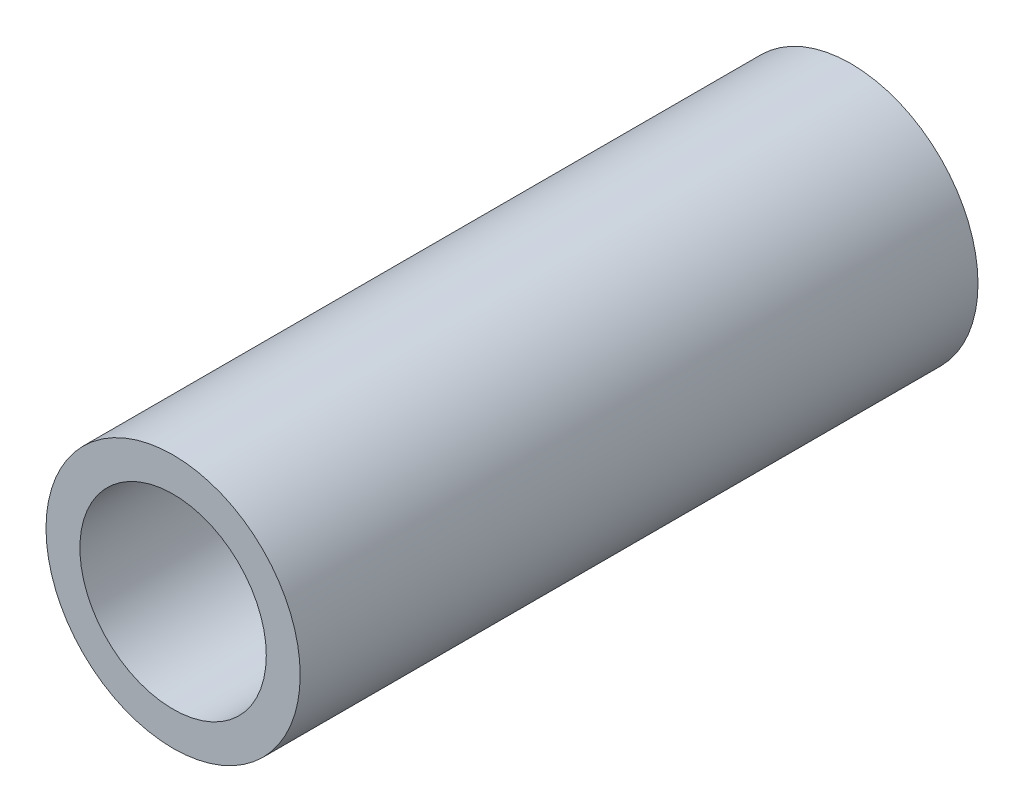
ISO-10303-21;
HEADER;
FILE_DESCRIPTION(('STEP AP214'),'2;1');
FILE_NAME('part.step','',(''),(''),'','','');
FILE_SCHEMA(('AUTOMOTIVE_DESIGN { 1 0 10303 214 1 1 1 1 }'));
ENDSEC;
DATA;
#1=APPLICATION_CONTEXT('core data for automotive mechanical design processes');
#2=APPLICATION_PROTOCOL_DEFINITION('international standard','automotive_design',2000,#1);
#3=PRODUCT_CONTEXT('',#1,'mechanical');
#4=PRODUCT('Part','Part','',(#3));
#5=PRODUCT_RELATED_PRODUCT_CATEGORY('part','',(#4));
#6=PRODUCT_DEFINITION_FORMATION('','',#4);
#7=PRODUCT_DEFINITION_CONTEXT('part definition',#1,'design');
#8=PRODUCT_DEFINITION('design','',#6,#7);
#9=PRODUCT_DEFINITION_SHAPE('','',#8);
#10=(LENGTH_UNIT() NAMED_UNIT(*) SI_UNIT(.MILLI.,.METRE.));
#11=(NAMED_UNIT(*) PLANE_ANGLE_UNIT() SI_UNIT($,.RADIAN.));
#12=(NAMED_UNIT(*) SI_UNIT($,.STERADIAN.) SOLID_ANGLE_UNIT());
#13=UNCERTAINTY_MEASURE_WITH_UNIT(LENGTH_MEASURE(1.E-05),#10,'distance_accuracy_value','');
#14=(GEOMETRIC_REPRESENTATION_CONTEXT(3) GLOBAL_UNCERTAINTY_ASSIGNED_CONTEXT((#13)) GLOBAL_UNIT_ASSIGNED_CONTEXT((#10,
#11,#12)) REPRESENTATION_CONTEXT('',''));
#15=CARTESIAN_POINT('',(0.,0.,0.));
#16=DIRECTION('',(0.,0.,1.));
#17=DIRECTION('',(1.,0.,0.));
#18=AXIS2_PLACEMENT_3D('',#15,#16,#17);
#19=CARTESIAN_POINT('',(-120.650000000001,61698.3070216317,50.8));
#20=DIRECTION('',(0.,0.,-1.));
#21=DIRECTION('',(-1.,0.,0.));
#22=AXIS2_PLACEMENT_3D('',#19,#20,#21);
#23=CYLINDRICAL_SURFACE('',#22,6.98500000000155);
#24=CARTESIAN_POINT('',(-120.650000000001,61698.3070216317,50.8));
#25=DIRECTION('',(0.,0.,1.));
#26=DIRECTION('',(1.,0.,0.));
#27=AXIS2_PLACEMENT_3D('',#24,#25,#26);
#28=CIRCLE('',#27,6.98500000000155);
#29=CARTESIAN_POINT('',(-113.665,61698.3070216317,50.8));
#30=VERTEX_POINT('',#29);
#31=EDGE_CURVE('E50',#30,#30,#28,.T.);
#32=ORIENTED_EDGE('',*,*,#31,.T.);
#33=EDGE_LOOP('',(#32));
#34=FACE_BOUND('',#33,.T.);
#35=CARTESIAN_POINT('',(-120.650000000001,61698.3070216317,0.));
#36=DIRECTION('',(0.,0.,1.));
#37=DIRECTION('',(1.,0.,0.));
#38=AXIS2_PLACEMENT_3D('',#35,#36,#37);
#39=CIRCLE('',#38,6.98500000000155);
#40=CARTESIAN_POINT('',(-113.665,61698.3070216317,0.));
#41=VERTEX_POINT('',#40);
#42=EDGE_CURVE('E56',#41,#41,#39,.T.);
#43=ORIENTED_EDGE('',*,*,#42,.F.);
#44=EDGE_LOOP('',(#43));
#45=FACE_BOUND('',#44,.T.);
#46=ADVANCED_FACE('F43',(#34,#45),#23,.F.);
#47=CARTESIAN_POINT('',(-120.650000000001,61698.3070216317,50.8));
#48=DIRECTION('',(0.,0.,-1.));
#49=DIRECTION('',(-1.,0.,0.));
#50=AXIS2_PLACEMENT_3D('',#47,#48,#49);
#51=CYLINDRICAL_SURFACE('',#50,9.52500000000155);
#52=CARTESIAN_POINT('',(-120.650000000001,61698.3070216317,50.8));
#53=DIRECTION('',(0.,0.,1.));
#54=DIRECTION('',(1.,0.,0.));
#55=AXIS2_PLACEMENT_3D('',#52,#53,#54);
#56=CIRCLE('',#55,9.52500000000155);
#57=CARTESIAN_POINT('',(-111.125,61698.3070216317,50.8));
#58=VERTEX_POINT('',#57);
#59=EDGE_CURVE('E10',#58,#58,#56,.T.);
#60=ORIENTED_EDGE('',*,*,#59,.F.);
#61=EDGE_LOOP('',(#60));
#62=FACE_BOUND('',#61,.T.);
#63=CARTESIAN_POINT('',(-120.650000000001,61698.3070216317,0.));
#64=DIRECTION('',(0.,0.,1.));
#65=DIRECTION('',(1.,0.,0.));
#66=AXIS2_PLACEMENT_3D('',#63,#64,#65);
#67=CIRCLE('',#66,9.52500000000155);
#68=CARTESIAN_POINT('',(-111.125,61698.3070216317,0.));
#69=VERTEX_POINT('',#68);
#70=EDGE_CURVE('E46',#69,#69,#67,.T.);
#71=ORIENTED_EDGE('',*,*,#70,.T.);
#72=EDGE_LOOP('',(#71));
#73=FACE_BOUND('',#72,.T.);
#74=ADVANCED_FACE('F63',(#62,#73),#51,.T.);
#75=CARTESIAN_POINT('',(0.,0.,50.8));
#76=DIRECTION('',(0.,0.,1.));
#77=DIRECTION('',(1.,0.,0.));
#78=AXIS2_PLACEMENT_3D('',#75,#76,#77);
#79=PLANE('',#78);
#80=ORIENTED_EDGE('',*,*,#31,.F.);
#81=EDGE_LOOP('',(#80));
#82=FACE_BOUND('',#81,.T.);
#83=ORIENTED_EDGE('',*,*,#59,.T.);
#84=EDGE_LOOP('',(#83));
#85=FACE_BOUND('',#84,.T.);
#86=ADVANCED_FACE('F67',(#82,#85),#79,.T.);
#87=CARTESIAN_POINT('',(0.,0.,0.));
#88=DIRECTION('',(0.,0.,1.));
#89=DIRECTION('',(1.,0.,0.));
#90=AXIS2_PLACEMENT_3D('',#87,#88,#89);
#91=PLANE('',#90);
#92=ORIENTED_EDGE('',*,*,#42,.T.);
#93=EDGE_LOOP('',(#92));
#94=FACE_BOUND('',#93,.T.);
#95=ORIENTED_EDGE('',*,*,#70,.F.);
#96=EDGE_LOOP('',(#95));
#97=FACE_BOUND('',#96,.T.);
#98=ADVANCED_FACE('F65',(#94,#97),#91,.F.);
#99=CLOSED_SHELL('',(#46,#74,#86,#98));
#100=MANIFOLD_SOLID_BREP('B2',#99);
#101=ADVANCED_BREP_SHAPE_REPRESENTATION('',(#18,#100),#14);
#102=SHAPE_DEFINITION_REPRESENTATION(#9,#101);
ENDSEC;
END-ISO-10303-21;
